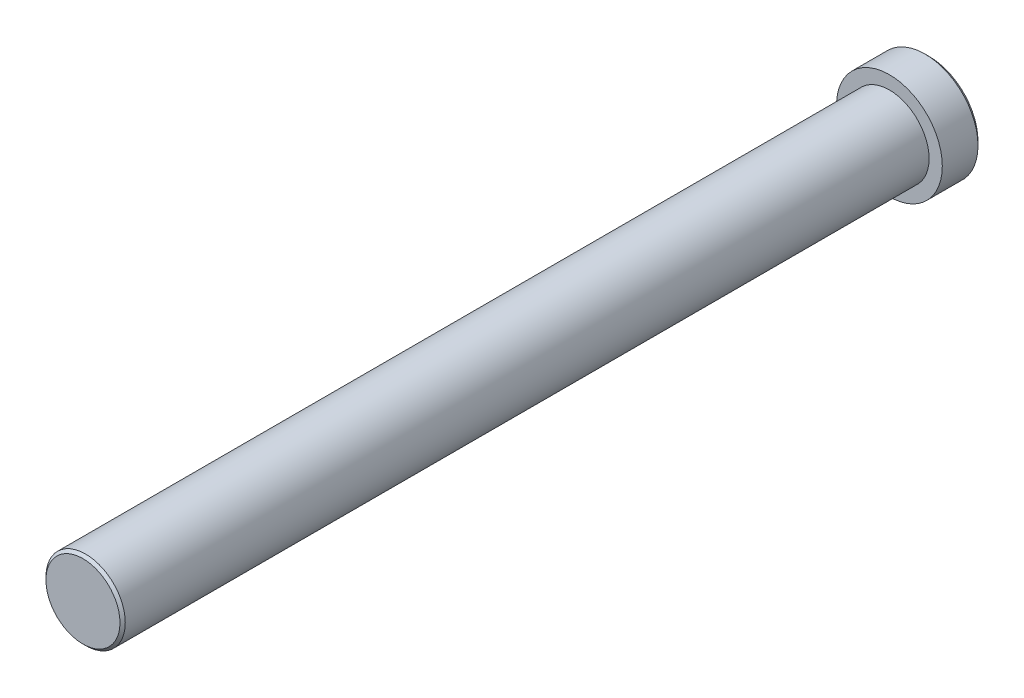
ISO-10303-21;
HEADER;
FILE_DESCRIPTION(('STEP AP214'),'2;1');
FILE_NAME('part.step','',(''),(''),'','','');
FILE_SCHEMA(('AUTOMOTIVE_DESIGN { 1 0 10303 214 1 1 1 1 }'));
ENDSEC;
DATA;
#1=APPLICATION_CONTEXT('core data for automotive mechanical design processes');
#2=APPLICATION_PROTOCOL_DEFINITION('international standard','automotive_design',2000,#1);
#3=PRODUCT_CONTEXT('',#1,'mechanical');
#4=PRODUCT('Part','Part','',(#3));
#5=PRODUCT_RELATED_PRODUCT_CATEGORY('part','',(#4));
#6=PRODUCT_DEFINITION_FORMATION('','',#4);
#7=PRODUCT_DEFINITION_CONTEXT('part definition',#1,'design');
#8=PRODUCT_DEFINITION('design','',#6,#7);
#9=PRODUCT_DEFINITION_SHAPE('','',#8);
#10=(LENGTH_UNIT() NAMED_UNIT(*) SI_UNIT(.MILLI.,.METRE.));
#11=(NAMED_UNIT(*) PLANE_ANGLE_UNIT() SI_UNIT($,.RADIAN.));
#12=(NAMED_UNIT(*) SI_UNIT($,.STERADIAN.) SOLID_ANGLE_UNIT());
#13=UNCERTAINTY_MEASURE_WITH_UNIT(LENGTH_MEASURE(1.E-05),#10,'distance_accuracy_value','');
#14=(GEOMETRIC_REPRESENTATION_CONTEXT(3) GLOBAL_UNCERTAINTY_ASSIGNED_CONTEXT((#13)) GLOBAL_UNIT_ASSIGNED_CONTEXT((#10,
#11,#12)) REPRESENTATION_CONTEXT('',''));
#15=CARTESIAN_POINT('',(0.,0.,0.));
#16=DIRECTION('',(0.,0.,1.));
#17=DIRECTION('',(1.,0.,0.));
#18=AXIS2_PLACEMENT_3D('',#15,#16,#17);
#19=CARTESIAN_POINT('',(0.,0.,1.5));
#20=DIRECTION('',(0.,0.,1.));
#21=DIRECTION('',(1.,0.,0.));
#22=AXIS2_PLACEMENT_3D('',#19,#20,#21);
#23=CYLINDRICAL_SURFACE('',#22,1.5);
#24=CARTESIAN_POINT('',(0.,0.,31.9));
#25=DIRECTION('',(0.,0.,1.));
#26=DIRECTION('',(1.,0.,0.));
#27=AXIS2_PLACEMENT_3D('',#24,#25,#26);
#28=CIRCLE('',#27,1.5);
#29=CARTESIAN_POINT('',(1.5,0.,31.9));
#30=VERTEX_POINT('',#29);
#31=EDGE_CURVE('E12',#30,#30,#28,.F.);
#32=ORIENTED_EDGE('',*,*,#31,.T.);
#33=EDGE_LOOP('',(#32));
#34=FACE_BOUND('',#33,.T.);
#35=CARTESIAN_POINT('',(0.,0.,1.5));
#36=DIRECTION('',(0.,0.,1.));
#37=DIRECTION('',(1.,0.,0.));
#38=AXIS2_PLACEMENT_3D('',#35,#36,#37);
#39=CIRCLE('',#38,1.5);
#40=CARTESIAN_POINT('',(1.5,0.,1.5));
#41=VERTEX_POINT('',#40);
#42=EDGE_CURVE('E192',#41,#41,#39,.T.);
#43=ORIENTED_EDGE('',*,*,#42,.T.);
#44=EDGE_LOOP('',(#43));
#45=FACE_BOUND('',#44,.T.);
#46=ADVANCED_FACE('F36',(#34,#45),#23,.T.);
#47=CARTESIAN_POINT('',(0.,0.,33.));
#48=DIRECTION('',(0.,0.,-1.));
#49=DIRECTION('',(-1.,0.,0.));
#50=AXIS2_PLACEMENT_3D('',#47,#48,#49);
#51=CYLINDRICAL_SURFACE('',#50,2.);
#52=CARTESIAN_POINT('',(0.,0.,0.14999999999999));
#53=DIRECTION('',(0.,0.,1.));
#54=DIRECTION('',(1.,0.,0.));
#55=AXIS2_PLACEMENT_3D('',#52,#53,#54);
#56=CIRCLE('',#55,2.);
#57=CARTESIAN_POINT('',(2.,0.,0.14999999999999));
#58=VERTEX_POINT('',#57);
#59=EDGE_CURVE('E215',#58,#58,#56,.T.);
#60=ORIENTED_EDGE('',*,*,#59,.T.);
#61=EDGE_LOOP('',(#60));
#62=FACE_BOUND('',#61,.T.);
#63=CARTESIAN_POINT('',(0.,0.,1.5));
#64=DIRECTION('',(0.,0.,1.));
#65=DIRECTION('',(1.,0.,0.));
#66=AXIS2_PLACEMENT_3D('',#63,#64,#65);
#67=CIRCLE('',#66,2.);
#68=CARTESIAN_POINT('',(2.,0.,1.5));
#69=VERTEX_POINT('',#68);
#70=EDGE_CURVE('E212',#69,#69,#67,.T.);
#71=ORIENTED_EDGE('',*,*,#70,.F.);
#72=EDGE_LOOP('',(#71));
#73=FACE_BOUND('',#72,.T.);
#74=ADVANCED_FACE('F234',(#62,#73),#51,.T.);
#75=CARTESIAN_POINT('',(0.,0.,0.));
#76=DIRECTION('',(0.,0.,1.));
#77=DIRECTION('',(1.,0.,0.));
#78=AXIS2_PLACEMENT_3D('',#75,#76,#77);
#79=PLANE('',#78);
#80=CARTESIAN_POINT('',(0.,0.,0.));
#81=DIRECTION('',(0.,0.,1.));
#82=DIRECTION('',(1.,0.,0.));
#83=AXIS2_PLACEMENT_3D('',#80,#81,#82);
#84=CIRCLE('',#83,1.85);
#85=CARTESIAN_POINT('',(1.85,0.,0.));
#86=VERTEX_POINT('',#85);
#87=EDGE_CURVE('E218',#86,#86,#84,.F.);
#88=ORIENTED_EDGE('',*,*,#87,.T.);
#89=EDGE_LOOP('',(#88));
#90=FACE_BOUND('',#89,.T.);
#91=DIRECTION('',(0.,-1.,0.));
#92=VECTOR('',#91,1.);
#93=CARTESIAN_POINT('',(0.5,-1.5,0.));
#94=LINE('',#93,#92);
#95=CARTESIAN_POINT('',(0.5,-0.5,0.));
#96=VERTEX_POINT('',#95);
#97=CARTESIAN_POINT('',(0.5,-1.5,0.));
#98=VERTEX_POINT('',#97);
#99=EDGE_CURVE('E161',#96,#98,#94,.T.);
#100=ORIENTED_EDGE('',*,*,#99,.F.);
#101=DIRECTION('',(-1.,0.,0.));
#102=VECTOR('',#101,1.);
#103=CARTESIAN_POINT('',(0.5,-0.5,0.));
#104=LINE('',#103,#102);
#105=CARTESIAN_POINT('',(1.5,-0.5,0.));
#106=VERTEX_POINT('',#105);
#107=EDGE_CURVE('E51',#106,#96,#104,.T.);
#108=ORIENTED_EDGE('',*,*,#107,.F.);
#109=DIRECTION('',(0.,-1.,0.));
#110=VECTOR('',#109,1.);
#111=CARTESIAN_POINT('',(1.5,0.5,0.));
#112=LINE('',#111,#110);
#113=CARTESIAN_POINT('',(1.5,0.5,0.));
#114=VERTEX_POINT('',#113);
#115=EDGE_CURVE('E188',#114,#106,#112,.T.);
#116=ORIENTED_EDGE('',*,*,#115,.F.);
#117=DIRECTION('',(1.,0.,0.));
#118=VECTOR('',#117,1.);
#119=CARTESIAN_POINT('',(0.5,0.5,0.));
#120=LINE('',#119,#118);
#121=CARTESIAN_POINT('',(0.5,0.5,0.));
#122=VERTEX_POINT('',#121);
#123=EDGE_CURVE('E186',#122,#114,#120,.T.);
#124=ORIENTED_EDGE('',*,*,#123,.F.);
#125=DIRECTION('',(0.,-1.,0.));
#126=VECTOR('',#125,1.);
#127=CARTESIAN_POINT('',(0.5,0.5,0.));
#128=LINE('',#127,#126);
#129=CARTESIAN_POINT('',(0.5,1.5,0.));
#130=VERTEX_POINT('',#129);
#131=EDGE_CURVE('E135',#130,#122,#128,.T.);
#132=ORIENTED_EDGE('',*,*,#131,.F.);
#133=DIRECTION('',(1.,0.,0.));
#134=VECTOR('',#133,1.);
#135=CARTESIAN_POINT('',(-0.5,1.5,0.));
#136=LINE('',#135,#134);
#137=CARTESIAN_POINT('',(-0.5,1.5,0.));
#138=VERTEX_POINT('',#137);
#139=EDGE_CURVE('E182',#138,#130,#136,.T.);
#140=ORIENTED_EDGE('',*,*,#139,.F.);
#141=DIRECTION('',(0.,1.,0.));
#142=VECTOR('',#141,1.);
#143=CARTESIAN_POINT('',(-0.5,0.5,0.));
#144=LINE('',#143,#142);
#145=CARTESIAN_POINT('',(-0.5,0.5,0.));
#146=VERTEX_POINT('',#145);
#147=EDGE_CURVE('E179',#146,#138,#144,.T.);
#148=ORIENTED_EDGE('',*,*,#147,.F.);
#149=DIRECTION('',(1.,0.,0.));
#150=VECTOR('',#149,1.);
#151=CARTESIAN_POINT('',(-1.5,0.5,0.));
#152=LINE('',#151,#150);
#153=CARTESIAN_POINT('',(-1.5,0.5,0.));
#154=VERTEX_POINT('',#153);
#155=EDGE_CURVE('E176',#154,#146,#152,.T.);
#156=ORIENTED_EDGE('',*,*,#155,.F.);
#157=DIRECTION('',(0.,1.,0.));
#158=VECTOR('',#157,1.);
#159=CARTESIAN_POINT('',(-1.5,0.5,0.));
#160=LINE('',#159,#158);
#161=CARTESIAN_POINT('',(-1.5,-0.5,0.));
#162=VERTEX_POINT('',#161);
#163=EDGE_CURVE('E173',#162,#154,#160,.T.);
#164=ORIENTED_EDGE('',*,*,#163,.F.);
#165=DIRECTION('',(-1.,0.,0.));
#166=VECTOR('',#165,1.);
#167=CARTESIAN_POINT('',(-1.5,-0.5,0.));
#168=LINE('',#167,#166);
#169=CARTESIAN_POINT('',(-0.5,-0.5,0.));
#170=VERTEX_POINT('',#169);
#171=EDGE_CURVE('E170',#170,#162,#168,.T.);
#172=ORIENTED_EDGE('',*,*,#171,.F.);
#173=DIRECTION('',(0.,1.,0.));
#174=VECTOR('',#173,1.);
#175=CARTESIAN_POINT('',(-0.5,-1.5,0.));
#176=LINE('',#175,#174);
#177=CARTESIAN_POINT('',(-0.5,-1.5,0.));
#178=VERTEX_POINT('',#177);
#179=EDGE_CURVE('E167',#178,#170,#176,.T.);
#180=ORIENTED_EDGE('',*,*,#179,.F.);
#181=DIRECTION('',(-1.,0.,0.));
#182=VECTOR('',#181,1.);
#183=CARTESIAN_POINT('',(-0.5,-1.5,0.));
#184=LINE('',#183,#182);
#185=EDGE_CURVE('E164',#98,#178,#184,.T.);
#186=ORIENTED_EDGE('',*,*,#185,.F.);
#187=EDGE_LOOP('',(#100,#108,#116,#124,#132,#140,#148,#156,#164,#172,#180,#186));
#188=FACE_BOUND('',#187,.T.);
#189=ADVANCED_FACE('F240',(#90,#188),#79,.F.);
#190=CARTESIAN_POINT('',(0.,0.,1.5));
#191=DIRECTION('',(0.,0.,1.));
#192=DIRECTION('',(1.,0.,0.));
#193=AXIS2_PLACEMENT_3D('',#190,#191,#192);
#194=PLANE('',#193);
#195=ORIENTED_EDGE('',*,*,#42,.F.);
#196=EDGE_LOOP('',(#195));
#197=FACE_BOUND('',#196,.T.);
#198=ORIENTED_EDGE('',*,*,#70,.T.);
#199=EDGE_LOOP('',(#198));
#200=FACE_BOUND('',#199,.T.);
#201=ADVANCED_FACE('F248',(#197,#200),#194,.T.);
#202=CARTESIAN_POINT('',(0.5,-0.5,1.));
#203=DIRECTION('',(0.,-1.,0.));
#204=DIRECTION('',(1.,0.,0.));
#205=AXIS2_PLACEMENT_3D('',#202,#203,#204);
#206=PLANE('',#205);
#207=ORIENTED_EDGE('',*,*,#107,.T.);
#208=DIRECTION('',(0.,0.,-1.));
#209=VECTOR('',#208,1.);
#210=CARTESIAN_POINT('',(0.5,-0.5,1.));
#211=LINE('',#210,#209);
#212=CARTESIAN_POINT('',(0.5,-0.5,1.));
#213=VERTEX_POINT('',#212);
#214=EDGE_CURVE('E99',#213,#96,#211,.T.);
#215=ORIENTED_EDGE('',*,*,#214,.F.);
#216=DIRECTION('',(-1.,0.,0.));
#217=VECTOR('',#216,1.);
#218=CARTESIAN_POINT('',(0.5,-0.5,1.));
#219=LINE('',#218,#217);
#220=CARTESIAN_POINT('',(1.5,-0.5,1.));
#221=VERTEX_POINT('',#220);
#222=EDGE_CURVE('E190',#221,#213,#219,.T.);
#223=ORIENTED_EDGE('',*,*,#222,.F.);
#224=DIRECTION('',(0.,0.,-1.));
#225=VECTOR('',#224,1.);
#226=CARTESIAN_POINT('',(1.5,-0.5,1.));
#227=LINE('',#226,#225);
#228=EDGE_CURVE('E59',#221,#106,#227,.T.);
#229=ORIENTED_EDGE('',*,*,#228,.T.);
#230=EDGE_LOOP('',(#207,#215,#223,#229));
#231=FACE_BOUND('',#230,.T.);
#232=ADVANCED_FACE('F246',(#231),#206,.F.);
#233=CARTESIAN_POINT('',(1.5,0.5,1.));
#234=DIRECTION('',(1.,0.,0.));
#235=DIRECTION('',(0.,0.,-1.));
#236=AXIS2_PLACEMENT_3D('',#233,#234,#235);
#237=PLANE('',#236);
#238=ORIENTED_EDGE('',*,*,#115,.T.);
#239=ORIENTED_EDGE('',*,*,#228,.F.);
#240=DIRECTION('',(0.,-1.,0.));
#241=VECTOR('',#240,1.);
#242=CARTESIAN_POINT('',(1.5,0.5,1.));
#243=LINE('',#242,#241);
#244=CARTESIAN_POINT('',(1.5,0.5,1.));
#245=VERTEX_POINT('',#244);
#246=EDGE_CURVE('E147',#245,#221,#243,.T.);
#247=ORIENTED_EDGE('',*,*,#246,.F.);
#248=DIRECTION('',(0.,0.,-1.));
#249=VECTOR('',#248,1.);
#250=CARTESIAN_POINT('',(1.5,0.5,1.));
#251=LINE('',#250,#249);
#252=EDGE_CURVE('E139',#245,#114,#251,.T.);
#253=ORIENTED_EDGE('',*,*,#252,.T.);
#254=EDGE_LOOP('',(#238,#239,#247,#253));
#255=FACE_BOUND('',#254,.T.);
#256=ADVANCED_FACE('F301',(#255),#237,.F.);
#257=CARTESIAN_POINT('',(0.5,0.5,1.));
#258=DIRECTION('',(0.,1.,0.));
#259=DIRECTION('',(-1.,0.,0.));
#260=AXIS2_PLACEMENT_3D('',#257,#258,#259);
#261=PLANE('',#260);
#262=ORIENTED_EDGE('',*,*,#123,.T.);
#263=ORIENTED_EDGE('',*,*,#252,.F.);
#264=DIRECTION('',(1.,0.,0.));
#265=VECTOR('',#264,1.);
#266=CARTESIAN_POINT('',(0.5,0.5,1.));
#267=LINE('',#266,#265);
#268=CARTESIAN_POINT('',(0.5,0.5,1.));
#269=VERTEX_POINT('',#268);
#270=EDGE_CURVE('E143',#269,#245,#267,.T.);
#271=ORIENTED_EDGE('',*,*,#270,.F.);
#272=DIRECTION('',(0.,0.,-1.));
#273=VECTOR('',#272,1.);
#274=CARTESIAN_POINT('',(0.5,0.5,1.));
#275=LINE('',#274,#273);
#276=EDGE_CURVE('E128',#269,#122,#275,.T.);
#277=ORIENTED_EDGE('',*,*,#276,.T.);
#278=EDGE_LOOP('',(#262,#263,#271,#277));
#279=FACE_BOUND('',#278,.T.);
#280=ADVANCED_FACE('F144',(#279),#261,.F.);
#281=CARTESIAN_POINT('',(0.5,0.5,1.));
#282=DIRECTION('',(1.,0.,0.));
#283=DIRECTION('',(0.,1.,0.));
#284=AXIS2_PLACEMENT_3D('',#281,#282,#283);
#285=PLANE('',#284);
#286=ORIENTED_EDGE('',*,*,#131,.T.);
#287=ORIENTED_EDGE('',*,*,#276,.F.);
#288=DIRECTION('',(0.,-1.,0.));
#289=VECTOR('',#288,1.);
#290=CARTESIAN_POINT('',(0.5,0.5,1.));
#291=LINE('',#290,#289);
#292=CARTESIAN_POINT('',(0.5,1.5,1.));
#293=VERTEX_POINT('',#292);
#294=EDGE_CURVE('E132',#293,#269,#291,.T.);
#295=ORIENTED_EDGE('',*,*,#294,.F.);
#296=DIRECTION('',(0.,0.,-1.));
#297=VECTOR('',#296,1.);
#298=CARTESIAN_POINT('',(0.5,1.5,1.));
#299=LINE('',#298,#297);
#300=EDGE_CURVE('E140',#293,#130,#299,.T.);
#301=ORIENTED_EDGE('',*,*,#300,.T.);
#302=EDGE_LOOP('',(#286,#287,#295,#301));
#303=FACE_BOUND('',#302,.T.);
#304=ADVANCED_FACE('F130',(#303),#285,.F.);
#305=CARTESIAN_POINT('',(-0.5,1.5,1.));
#306=DIRECTION('',(0.,1.,0.));
#307=DIRECTION('',(0.,0.,1.));
#308=AXIS2_PLACEMENT_3D('',#305,#306,#307);
#309=PLANE('',#308);
#310=ORIENTED_EDGE('',*,*,#139,.T.);
#311=ORIENTED_EDGE('',*,*,#300,.F.);
#312=DIRECTION('',(1.,0.,0.));
#313=VECTOR('',#312,1.);
#314=CARTESIAN_POINT('',(-0.5,1.5,1.));
#315=LINE('',#314,#313);
#316=CARTESIAN_POINT('',(-0.5,1.5,1.));
#317=VERTEX_POINT('',#316);
#318=EDGE_CURVE('E153',#317,#293,#315,.T.);
#319=ORIENTED_EDGE('',*,*,#318,.F.);
#320=DIRECTION('',(0.,0.,-1.));
#321=VECTOR('',#320,1.);
#322=CARTESIAN_POINT('',(-0.5,1.5,1.));
#323=LINE('',#322,#321);
#324=EDGE_CURVE('E195',#317,#138,#323,.T.);
#325=ORIENTED_EDGE('',*,*,#324,.T.);
#326=EDGE_LOOP('',(#310,#311,#319,#325));
#327=FACE_BOUND('',#326,.T.);
#328=ADVANCED_FACE('F300',(#327),#309,.F.);
#329=CARTESIAN_POINT('',(-0.5,0.5,1.));
#330=DIRECTION('',(-1.,0.,0.));
#331=DIRECTION('',(0.,-1.,0.));
#332=AXIS2_PLACEMENT_3D('',#329,#330,#331);
#333=PLANE('',#332);
#334=ORIENTED_EDGE('',*,*,#147,.T.);
#335=ORIENTED_EDGE('',*,*,#324,.F.);
#336=DIRECTION('',(0.,1.,0.));
#337=VECTOR('',#336,1.);
#338=CARTESIAN_POINT('',(-0.5,0.5,1.));
#339=LINE('',#338,#337);
#340=CARTESIAN_POINT('',(-0.5,0.5,1.));
#341=VERTEX_POINT('',#340);
#342=EDGE_CURVE('E155',#341,#317,#339,.T.);
#343=ORIENTED_EDGE('',*,*,#342,.F.);
#344=DIRECTION('',(0.,0.,-1.));
#345=VECTOR('',#344,1.);
#346=CARTESIAN_POINT('',(-0.5,0.5,1.));
#347=LINE('',#346,#345);
#348=EDGE_CURVE('E197',#341,#146,#347,.T.);
#349=ORIENTED_EDGE('',*,*,#348,.T.);
#350=EDGE_LOOP('',(#334,#335,#343,#349));
#351=FACE_BOUND('',#350,.T.);
#352=ADVANCED_FACE('F296',(#351),#333,.F.);
#353=CARTESIAN_POINT('',(-1.5,0.5,1.));
#354=DIRECTION('',(0.,1.,0.));
#355=DIRECTION('',(-1.,0.,0.));
#356=AXIS2_PLACEMENT_3D('',#353,#354,#355);
#357=PLANE('',#356);
#358=ORIENTED_EDGE('',*,*,#155,.T.);
#359=ORIENTED_EDGE('',*,*,#348,.F.);
#360=DIRECTION('',(1.,0.,0.));
#361=VECTOR('',#360,1.);
#362=CARTESIAN_POINT('',(-1.5,0.5,1.));
#363=LINE('',#362,#361);
#364=CARTESIAN_POINT('',(-1.5,0.5,1.));
#365=VERTEX_POINT('',#364);
#366=EDGE_CURVE('E291',#365,#341,#363,.T.);
#367=ORIENTED_EDGE('',*,*,#366,.F.);
#368=DIRECTION('',(0.,0.,-1.));
#369=VECTOR('',#368,1.);
#370=CARTESIAN_POINT('',(-1.5,0.5,1.));
#371=LINE('',#370,#369);
#372=EDGE_CURVE('E199',#365,#154,#371,.T.);
#373=ORIENTED_EDGE('',*,*,#372,.T.);
#374=EDGE_LOOP('',(#358,#359,#367,#373));
#375=FACE_BOUND('',#374,.T.);
#376=ADVANCED_FACE('F316',(#375),#357,.F.);
#377=CARTESIAN_POINT('',(-1.5,0.5,1.));
#378=DIRECTION('',(-1.,0.,0.));
#379=DIRECTION('',(0.,0.,1.));
#380=AXIS2_PLACEMENT_3D('',#377,#378,#379);
#381=PLANE('',#380);
#382=ORIENTED_EDGE('',*,*,#163,.T.);
#383=ORIENTED_EDGE('',*,*,#372,.F.);
#384=DIRECTION('',(0.,1.,0.));
#385=VECTOR('',#384,1.);
#386=CARTESIAN_POINT('',(-1.5,0.5,1.));
#387=LINE('',#386,#385);
#388=CARTESIAN_POINT('',(-1.5,-0.5,1.));
#389=VERTEX_POINT('',#388);
#390=EDGE_CURVE('E288',#389,#365,#387,.T.);
#391=ORIENTED_EDGE('',*,*,#390,.F.);
#392=DIRECTION('',(0.,0.,-1.));
#393=VECTOR('',#392,1.);
#394=CARTESIAN_POINT('',(-1.5,-0.5,1.));
#395=LINE('',#394,#393);
#396=EDGE_CURVE('E201',#389,#162,#395,.T.);
#397=ORIENTED_EDGE('',*,*,#396,.T.);
#398=EDGE_LOOP('',(#382,#383,#391,#397));
#399=FACE_BOUND('',#398,.T.);
#400=ADVANCED_FACE('F319',(#399),#381,.F.);
#401=CARTESIAN_POINT('',(-1.5,-0.5,1.));
#402=DIRECTION('',(0.,-1.,0.));
#403=DIRECTION('',(0.,0.,-1.));
#404=AXIS2_PLACEMENT_3D('',#401,#402,#403);
#405=PLANE('',#404);
#406=ORIENTED_EDGE('',*,*,#171,.T.);
#407=ORIENTED_EDGE('',*,*,#396,.F.);
#408=DIRECTION('',(-1.,0.,0.));
#409=VECTOR('',#408,1.);
#410=CARTESIAN_POINT('',(-1.5,-0.5,1.));
#411=LINE('',#410,#409);
#412=CARTESIAN_POINT('',(-0.5,-0.5,1.));
#413=VERTEX_POINT('',#412);
#414=EDGE_CURVE('E285',#413,#389,#411,.T.);
#415=ORIENTED_EDGE('',*,*,#414,.F.);
#416=DIRECTION('',(0.,0.,-1.));
#417=VECTOR('',#416,1.);
#418=CARTESIAN_POINT('',(-0.5,-0.5,1.));
#419=LINE('',#418,#417);
#420=EDGE_CURVE('E203',#413,#170,#419,.T.);
#421=ORIENTED_EDGE('',*,*,#420,.T.);
#422=EDGE_LOOP('',(#406,#407,#415,#421));
#423=FACE_BOUND('',#422,.T.);
#424=ADVANCED_FACE('F323',(#423),#405,.F.);
#425=CARTESIAN_POINT('',(-0.5,-1.5,1.));
#426=DIRECTION('',(-1.,0.,0.));
#427=DIRECTION('',(0.,-1.,0.));
#428=AXIS2_PLACEMENT_3D('',#425,#426,#427);
#429=PLANE('',#428);
#430=ORIENTED_EDGE('',*,*,#179,.T.);
#431=ORIENTED_EDGE('',*,*,#420,.F.);
#432=DIRECTION('',(0.,1.,0.));
#433=VECTOR('',#432,1.);
#434=CARTESIAN_POINT('',(-0.5,-1.5,1.));
#435=LINE('',#434,#433);
#436=CARTESIAN_POINT('',(-0.5,-1.5,1.));
#437=VERTEX_POINT('',#436);
#438=EDGE_CURVE('E282',#437,#413,#435,.T.);
#439=ORIENTED_EDGE('',*,*,#438,.F.);
#440=DIRECTION('',(0.,0.,-1.));
#441=VECTOR('',#440,1.);
#442=CARTESIAN_POINT('',(-0.5,-1.5,1.));
#443=LINE('',#442,#441);
#444=EDGE_CURVE('E205',#437,#178,#443,.T.);
#445=ORIENTED_EDGE('',*,*,#444,.T.);
#446=EDGE_LOOP('',(#430,#431,#439,#445));
#447=FACE_BOUND('',#446,.T.);
#448=ADVANCED_FACE('F327',(#447),#429,.F.);
#449=CARTESIAN_POINT('',(-0.5,-1.5,1.));
#450=DIRECTION('',(0.,-1.,0.));
#451=DIRECTION('',(0.,0.,-1.));
#452=AXIS2_PLACEMENT_3D('',#449,#450,#451);
#453=PLANE('',#452);
#454=ORIENTED_EDGE('',*,*,#185,.T.);
#455=ORIENTED_EDGE('',*,*,#444,.F.);
#456=DIRECTION('',(-1.,0.,0.));
#457=VECTOR('',#456,1.);
#458=CARTESIAN_POINT('',(-0.5,-1.5,1.));
#459=LINE('',#458,#457);
#460=CARTESIAN_POINT('',(0.5,-1.5,1.));
#461=VERTEX_POINT('',#460);
#462=EDGE_CURVE('E277',#461,#437,#459,.T.);
#463=ORIENTED_EDGE('',*,*,#462,.F.);
#464=DIRECTION('',(0.,0.,-1.));
#465=VECTOR('',#464,1.);
#466=CARTESIAN_POINT('',(0.5,-1.5,1.));
#467=LINE('',#466,#465);
#468=EDGE_CURVE('E207',#461,#98,#467,.T.);
#469=ORIENTED_EDGE('',*,*,#468,.T.);
#470=EDGE_LOOP('',(#454,#455,#463,#469));
#471=FACE_BOUND('',#470,.T.);
#472=ADVANCED_FACE('F331',(#471),#453,.F.);
#473=CARTESIAN_POINT('',(0.5,-1.5,1.));
#474=DIRECTION('',(1.,0.,0.));
#475=DIRECTION('',(0.,1.,0.));
#476=AXIS2_PLACEMENT_3D('',#473,#474,#475);
#477=PLANE('',#476);
#478=ORIENTED_EDGE('',*,*,#99,.T.);
#479=ORIENTED_EDGE('',*,*,#468,.F.);
#480=DIRECTION('',(0.,-1.,0.));
#481=VECTOR('',#480,1.);
#482=CARTESIAN_POINT('',(0.5,-1.5,1.));
#483=LINE('',#482,#481);
#484=EDGE_CURVE('E275',#213,#461,#483,.T.);
#485=ORIENTED_EDGE('',*,*,#484,.F.);
#486=ORIENTED_EDGE('',*,*,#214,.T.);
#487=EDGE_LOOP('',(#478,#479,#485,#486));
#488=FACE_BOUND('',#487,.T.);
#489=ADVANCED_FACE('F259',(#488),#477,.F.);
#490=CARTESIAN_POINT('',(0.,0.,1.));
#491=DIRECTION('',(0.,0.,-1.));
#492=DIRECTION('',(-1.,0.,0.));
#493=AXIS2_PLACEMENT_3D('',#490,#491,#492);
#494=PLANE('',#493);
#495=ORIENTED_EDGE('',*,*,#222,.T.);
#496=ORIENTED_EDGE('',*,*,#484,.T.);
#497=ORIENTED_EDGE('',*,*,#462,.T.);
#498=ORIENTED_EDGE('',*,*,#438,.T.);
#499=ORIENTED_EDGE('',*,*,#414,.T.);
#500=ORIENTED_EDGE('',*,*,#390,.T.);
#501=ORIENTED_EDGE('',*,*,#366,.T.);
#502=ORIENTED_EDGE('',*,*,#342,.T.);
#503=ORIENTED_EDGE('',*,*,#318,.T.);
#504=ORIENTED_EDGE('',*,*,#294,.T.);
#505=ORIENTED_EDGE('',*,*,#270,.T.);
#506=ORIENTED_EDGE('',*,*,#246,.T.);
#507=EDGE_LOOP('',(#495,#496,#497,#498,#499,#500,#501,#502,#503,#504,#505,#506));
#508=FACE_BOUND('',#507,.T.);
#509=ADVANCED_FACE('F150',(#508),#494,.T.);
#510=CARTESIAN_POINT('',(0.,0.,0.14999999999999));
#511=DIRECTION('',(0.,0.,1.));
#512=DIRECTION('',(1.,0.,0.));
#513=AXIS2_PLACEMENT_3D('',#510,#511,#512);
#514=CONICAL_SURFACE('',#513,2.,0.785398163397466);
#515=ORIENTED_EDGE('',*,*,#87,.F.);
#516=EDGE_LOOP('',(#515));
#517=FACE_BOUND('',#516,.T.);
#518=ORIENTED_EDGE('',*,*,#59,.F.);
#519=EDGE_LOOP('',(#518));
#520=FACE_BOUND('',#519,.T.);
#521=ADVANCED_FACE('F230',(#517,#520),#514,.T.);
#522=CARTESIAN_POINT('',(0.,0.,32.));
#523=DIRECTION('',(0.,0.,1.));
#524=DIRECTION('',(1.,0.,0.));
#525=AXIS2_PLACEMENT_3D('',#522,#523,#524);
#526=PLANE('',#525);
#527=CARTESIAN_POINT('',(0.,0.,32.));
#528=DIRECTION('',(0.,0.,1.));
#529=DIRECTION('',(1.,0.,0.));
#530=AXIS2_PLACEMENT_3D('',#527,#528,#529);
#531=CIRCLE('',#530,1.40000000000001);
#532=CARTESIAN_POINT('',(1.40000000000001,0.,32.));
#533=VERTEX_POINT('',#532);
#534=EDGE_CURVE('E44',#533,#533,#531,.T.);
#535=ORIENTED_EDGE('',*,*,#534,.T.);
#536=EDGE_LOOP('',(#535));
#537=FACE_BOUND('',#536,.T.);
#538=ADVANCED_FACE('F223',(#537),#526,.T.);
#539=CARTESIAN_POINT('',(0.,0.,32.));
#540=DIRECTION('',(0.,0.,-1.));
#541=DIRECTION('',(-1.,0.,0.));
#542=AXIS2_PLACEMENT_3D('',#539,#540,#541);
#543=CONICAL_SURFACE('',#542,1.40000000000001,0.785398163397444);
#544=ORIENTED_EDGE('',*,*,#31,.F.);
#545=EDGE_LOOP('',(#544));
#546=FACE_BOUND('',#545,.T.);
#547=ORIENTED_EDGE('',*,*,#534,.F.);
#548=EDGE_LOOP('',(#547));
#549=FACE_BOUND('',#548,.T.);
#550=ADVANCED_FACE('F38',(#546,#549),#543,.T.);
#551=CLOSED_SHELL('',(#46,#74,#189,#201,#232,#256,#280,#304,#328,#352,#376,#400,#424,#448,#472,
#489,#509,#521,#538,#550));
#552=MANIFOLD_SOLID_BREP('B2',#551);
#553=ADVANCED_BREP_SHAPE_REPRESENTATION('',(#18,#552),#14);
#554=SHAPE_DEFINITION_REPRESENTATION(#9,#553);
ENDSEC;
END-ISO-10303-21;
